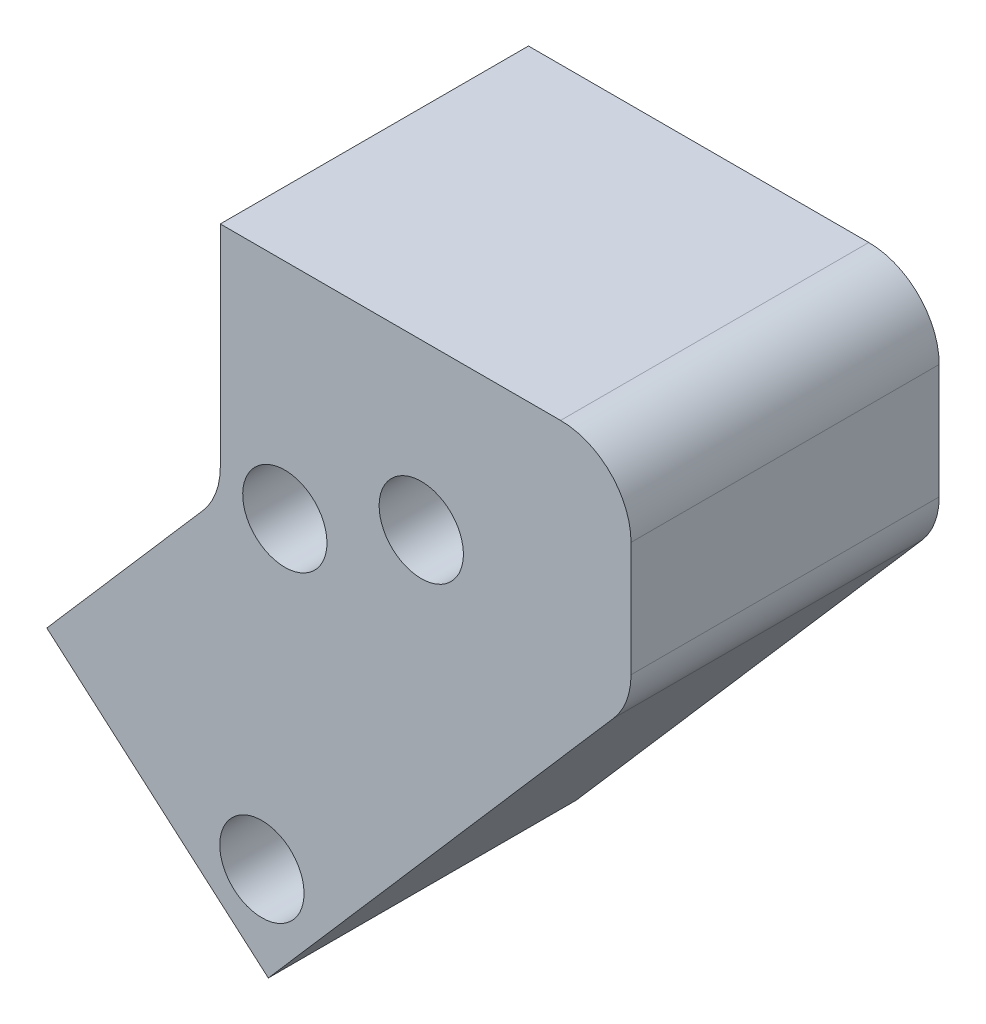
from build123d import *

# Parameters (mm, degrees)
BOSS_EXTRUDE1_DEPTH     = 57.7596
CUT_EXTRUDE3_DEPTH      = 511.085159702
CUT_EXTRUDE3_DEPTH_BACK = 511.085159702
HOLE1_D                 = 5.6134
HOLE1_CBORE_D           = 9.1186
HOLE1_CBORE_DEPTH       = 8.636


with BuildPart() as part:
    # Sketch1 → Boss-Extrude1 (new body)
    with BuildSketch(Plane.XY.offset(-31.75)):
        with BuildLine():
            Line((-619.125, -20.819872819), (-619.125, -33.227682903))
            ThreePointArc((-619.125, -33.227682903), (-619.606906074, -35.894519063), (-620.99167063, -38.224041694))
            Line((-620.99167063, -38.224041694), (-658.377463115, -81.273948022))
            Line((-658.377463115, -81.273948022), (-682.349668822, -60.455786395))
            Line((-682.349668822, -60.455786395), (-665.44167063, -40.986151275))
            ThreePointArc((-665.44167063, -40.986151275), (-664.056906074, -38.656628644), (-663.575, -35.989792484))
            Line((-663.575, -35.989792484), (-663.575, -13.199872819))
            Line((-663.575, -13.199872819), (-626.745, -13.199872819))
            ThreePointArc((-626.745, -13.199872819), (-621.356846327, -15.431719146), (-619.125, -20.819872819))
        make_face()
    extrude(amount=BOSS_EXTRUDE1_DEPTH)

    # Sketch2 → Cut-Extrude3 (cut, two sides: drawn at the far end of the back side and taken through both)
    with BuildSketch(Plane(origin=(-335.085588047, 290.998084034, 0), x_dir=(0, 0, -1), z_dir=(0.7550301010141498, -0.6556901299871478, 0)).offset(-CUT_EXTRUDE3_DEPTH_BACK)):
        with BuildLine():
            Line((-1.599861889, -96.570092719), (-1.599861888, -377.485881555))
            Line((-1.599861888, -377.485881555), (-1.599861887, -493.055881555))
            Line((-1.599861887, -493.055881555), (-0.508, -493.055881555))
            ThreePointArc((-0.508, -493.055881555), (-0.148789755, -493.204671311), (0, -493.563881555))
            Line((0, -493.563881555), (0, -544.363881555))
            Line((0, -544.363881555), (0, -825.279670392))
            Line((0, -825.279670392), (-561.830223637, -826.513153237))
            Line((-561.830223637, -826.513153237), (-563.430085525, -97.803575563))
            Line((-563.430085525, -97.803575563), (-1.599861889, -96.570092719))
        make_face()
    extrude(amount=CUT_EXTRUDE3_DEPTH + CUT_EXTRUDE3_DEPTH_BACK, mode=Mode.SUBTRACT)

    # Hole1 (through all)
    with Locations(Plane(origin=(-671.940459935, -70.485067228, 1.599861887), x_dir=(1.0, 0, 2.451127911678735e-12), z_dir=(-2.451127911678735e-12, -2.8224846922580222e-12, 1.0))):
        with Locations((12.869107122, -0.934999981), (15.350459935, 33.155194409), (30.114664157, 39.47647494)):
            CounterBoreHole(HOLE1_D / 2, HOLE1_CBORE_D / 2, HOLE1_CBORE_DEPTH)


solid = part.part
